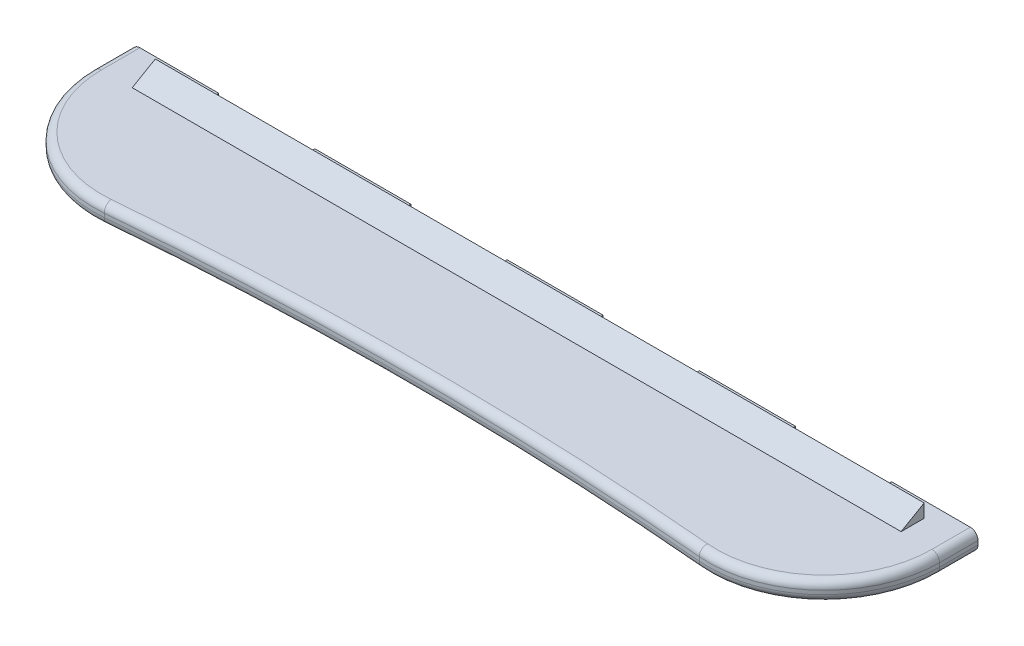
from build123d import *

# Parameters (mm, degrees)
EXTRUDE_1_DEPTH     = 5
EXTRUDE_START       = -10
EXTRUDE_2_DEPTH     = 200
CUT_EXTRUDE_1_DEPTH = 4
FILLET_1_R          = 2


with BuildPart() as part:
    # Sketch 1 → Extrude 1 (new body)
    with BuildSketch(Plane(origin=(0, 0, 0), x_dir=(1, 0, 0), z_dir=(0, 1, 0))):
        with BuildLine():
            Line((-110, 10), (-110, 20))
            Line((-110, 20), (-87.5, 20))
            Line((-87.5, 20), (-87.5, 16))
            Line((-87.5, 16), (-62.5, 16))
            Line((-62.5, 16), (-62.5, 20))
            Line((-62.5, 20), (-37.5, 20))
            Line((-37.5, 20), (-37.5, 16))
            Line((-37.5, 16), (-12.5, 16))
            Line((-12.5, 16), (-12.5, 20))
            Line((-12.5, 20), (12.5, 20))
            Line((12.5, 20), (12.5, 16))
            Line((12.5, 16), (37.5, 16))
            Line((37.5, 16), (37.5, 20))
            Line((37.5, 20), (62.5, 20))
            Line((62.5, 20), (62.5, 16))
            Line((62.5, 16), (87.5, 16))
            Line((87.5, 16), (87.5, 20))
            Line((87.5, 20), (110, 20))
            Line((110, 20), (110, 10))
            ThreePointArc((110, 10), (100.267706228, -12.118320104), (77.385327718, -19.885840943))
            ThreePointArc((77.385327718, -19.885840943), (0, -16.507124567), (-77.385327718, -19.885840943))
            ThreePointArc((-77.385327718, -19.885840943), (-100.267706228, -12.118320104), (-110, 10))
        make_face()
    extrude(amount=EXTRUDE_1_DEPTH)

    # Sketch 2 → Extrude 2 (add)
    with BuildSketch(Plane(origin=(110, 0, 0), x_dir=(0, 0, -1), z_dir=(1, 0, 0)).offset(EXTRUDE_START)):
        Polygon((10, 5), (16, 8.464101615), (16, 5), align=None)
    extrude(amount=-EXTRUDE_2_DEPTH)

    # Sketch 3 → Cut-Extrude 1 (cut)
    with BuildSketch(Plane.XZ):
        with BuildLine():
            Line((73, 13.75), (67, 13.75))
            ThreePointArc((67, 13.75), (65.25, 12), (67, 10.25))
            Line((67, 10.25), (73, 10.25))
            ThreePointArc((73, 10.25), (74.75, 12), (73, 13.75))
        make_face()
        with BuildLine():
            Line((93, 10.25), (87, 10.25))
            ThreePointArc((87, 10.25), (85.25, 12), (87, 13.75))
            Line((87, 13.75), (93, 13.75))
            ThreePointArc((93, 13.75), (94.75, 12), (93, 10.25))
        make_face()
        with BuildLine():
            Line((53, 13.75), (47, 13.75))
            ThreePointArc((47, 13.75), (45.25, 12), (47, 10.25))
            Line((47, 10.25), (53, 10.25))
            ThreePointArc((53, 10.25), (54.75, 12), (53, 13.75))
        make_face()
        with BuildLine():
            Line((33, 13.75), (27, 13.75))
            ThreePointArc((27, 13.75), (25.25, 12), (27, 10.25))
            Line((27, 10.25), (33, 10.25))
            ThreePointArc((33, 10.25), (34.75, 12), (33, 13.75))
        make_face()
        with BuildLine():
            Line((13, 13.75), (7, 13.75))
            ThreePointArc((7, 13.75), (5.25, 12), (7, 10.25))
            Line((7, 10.25), (13, 10.25))
            ThreePointArc((13, 10.25), (14.75, 12), (13, 13.75))
        make_face()
        with BuildLine():
            Line((-7, 13.75), (-13, 13.75))
            ThreePointArc((-13, 13.75), (-14.75, 12), (-13, 10.25))
            Line((-13, 10.25), (-7, 10.25))
            ThreePointArc((-7, 10.25), (-5.25, 12), (-7, 13.75))
        make_face()
        with BuildLine():
            Line((-27, 13.75), (-33, 13.75))
            ThreePointArc((-33, 13.75), (-34.75, 12), (-33, 10.25))
            Line((-33, 10.25), (-27, 10.25))
            ThreePointArc((-27, 10.25), (-25.25, 12), (-27, 13.75))
        make_face()
        with BuildLine():
            Line((-47, 13.75), (-53, 13.75))
            ThreePointArc((-53, 13.75), (-54.75, 12), (-53, 10.25))
            Line((-53, 10.25), (-47, 10.25))
            ThreePointArc((-47, 10.25), (-45.25, 12), (-47, 13.75))
        make_face()
        with BuildLine():
            Line((-67, 13.75), (-73, 13.75))
            ThreePointArc((-73, 13.75), (-74.75, 12), (-73, 10.25))
            Line((-73, 10.25), (-67, 10.25))
            ThreePointArc((-67, 10.25), (-65.25, 12), (-67, 13.75))
        make_face()
        with BuildLine():
            Line((-87, 13.75), (-93, 13.75))
            ThreePointArc((-93, 13.75), (-94.75, 12), (-93, 10.25))
            Line((-93, 10.25), (-87, 10.25))
            ThreePointArc((-87, 10.25), (-85.25, 12), (-87, 13.75))
        make_face()
    extrude(amount=-CUT_EXTRUDE_1_DEPTH, mode=Mode.SUBTRACT)

    # Fillet 1
    fillet_1_edges = [part.edges().sort_by_distance(p)[0] for p in [
        (-100.267706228, 5, 12.118320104),
        (0, 5, 16.507124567),
        (100.267706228, 5, 12.118320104),
        (110, 5, -15),
        (110, 0, -15),
        (100.267706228, 0, 12.118320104),
        (0, 0, 16.507124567),
        (-100.267706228, 0, 12.118320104),
        (-110, 0, -15),
        (-110, 5, -15),
    ]]
    fillet(fillet_1_edges, radius=FILLET_1_R)


solid = part.part
